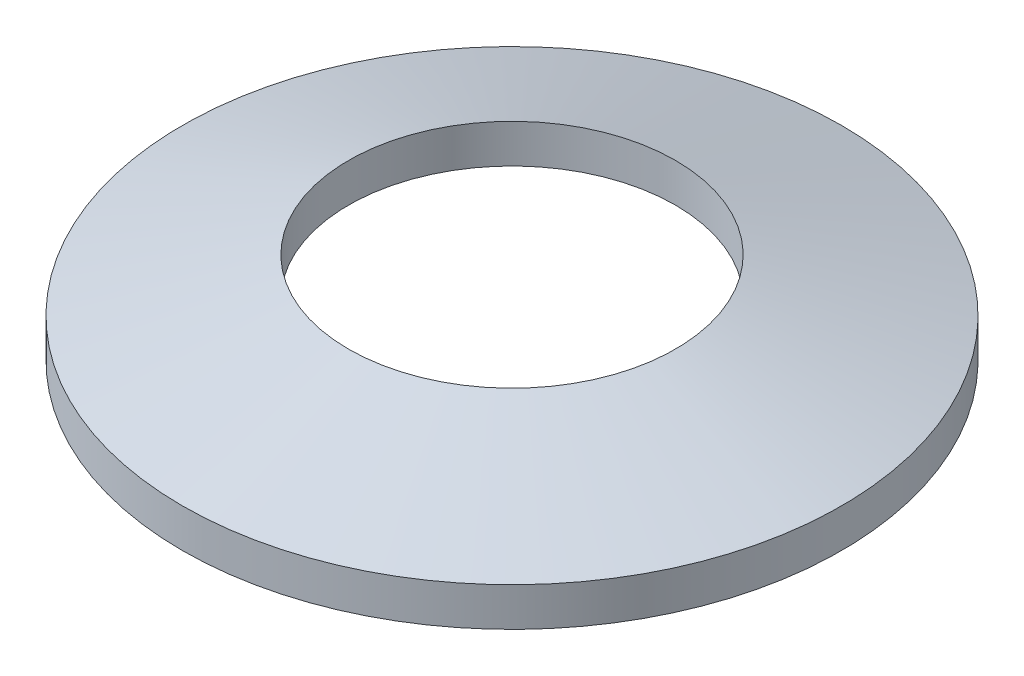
from build123d import *


with BuildPart() as part:
    # Esquisse1 → R_volution1 (revolve)
    with BuildSketch(Plane.XY, mode=Mode.PRIVATE) as r_volution1_sk:
        Polygon((-6.25, 0), (-3.1, 1), (-3.1, 1.734426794), (-6.25, 0.734426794), align=None)
    revolve(r_volution1_sk.sketch.rotate(Axis((0, 21.268397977, 0), (0, -1, 0)), 270), axis=Axis((0, 21.268397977, 0), (0, -1, 0)))


solid = part.part
